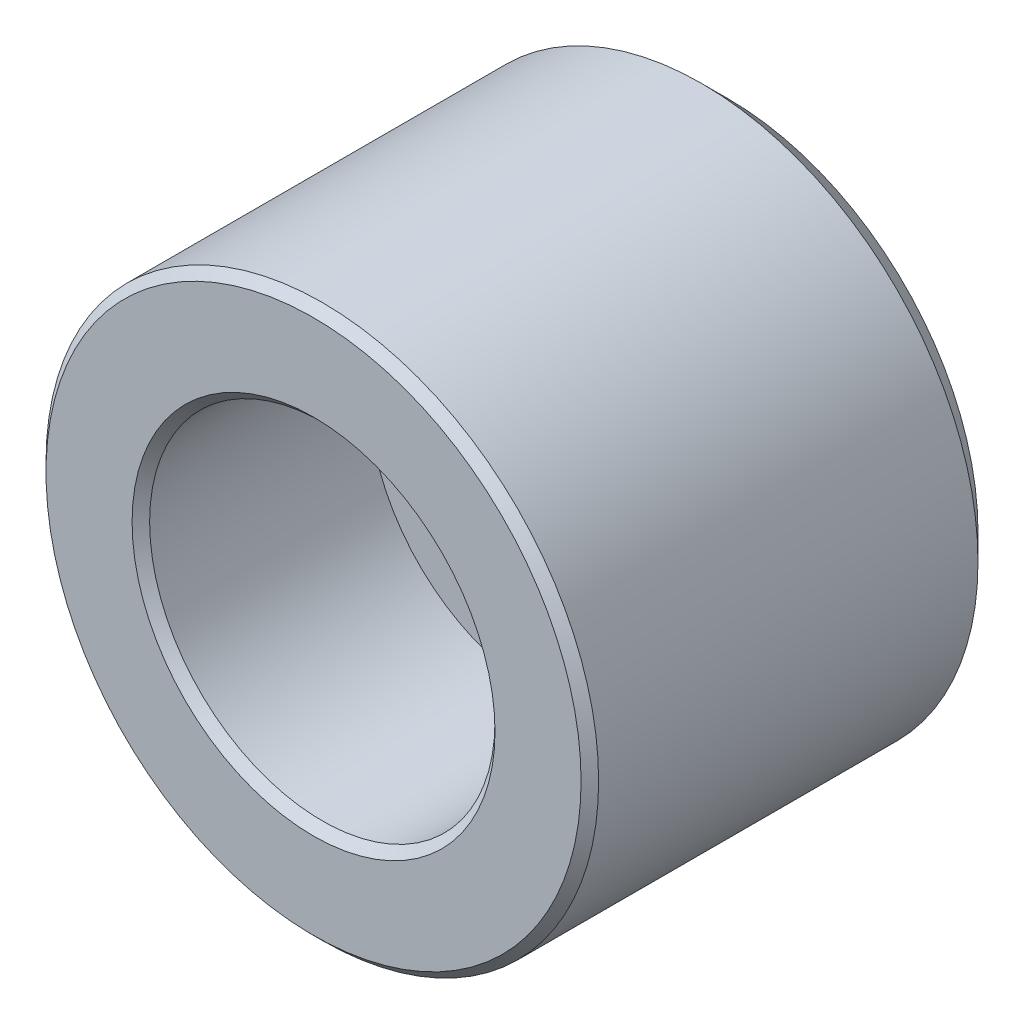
ISO-10303-21;
HEADER;
FILE_DESCRIPTION(('STEP AP214'),'2;1');
FILE_NAME('part.step','',(''),(''),'','','');
FILE_SCHEMA(('AUTOMOTIVE_DESIGN { 1 0 10303 214 1 1 1 1 }'));
ENDSEC;
DATA;
#1=APPLICATION_CONTEXT('core data for automotive mechanical design processes');
#2=APPLICATION_PROTOCOL_DEFINITION('international standard','automotive_design',2000,#1);
#3=PRODUCT_CONTEXT('',#1,'mechanical');
#4=PRODUCT('Part','Part','',(#3));
#5=PRODUCT_RELATED_PRODUCT_CATEGORY('part','',(#4));
#6=PRODUCT_DEFINITION_FORMATION('','',#4);
#7=PRODUCT_DEFINITION_CONTEXT('part definition',#1,'design');
#8=PRODUCT_DEFINITION('design','',#6,#7);
#9=PRODUCT_DEFINITION_SHAPE('','',#8);
#10=(LENGTH_UNIT() NAMED_UNIT(*) SI_UNIT(.MILLI.,.METRE.));
#11=(NAMED_UNIT(*) PLANE_ANGLE_UNIT() SI_UNIT($,.RADIAN.));
#12=(NAMED_UNIT(*) SI_UNIT($,.STERADIAN.) SOLID_ANGLE_UNIT());
#13=UNCERTAINTY_MEASURE_WITH_UNIT(LENGTH_MEASURE(1.E-05),#10,'distance_accuracy_value','');
#14=(GEOMETRIC_REPRESENTATION_CONTEXT(3) GLOBAL_UNCERTAINTY_ASSIGNED_CONTEXT((#13)) GLOBAL_UNIT_ASSIGNED_CONTEXT((#10,
#11,#12)) REPRESENTATION_CONTEXT('',''));
#15=CARTESIAN_POINT('',(0.,0.,0.));
#16=DIRECTION('',(0.,0.,1.));
#17=DIRECTION('',(1.,0.,0.));
#18=AXIS2_PLACEMENT_3D('',#15,#16,#17);
#19=CARTESIAN_POINT('',(0.,0.,12.));
#20=DIRECTION('',(0.,0.,1.));
#21=DIRECTION('',(1.,0.,0.));
#22=AXIS2_PLACEMENT_3D('',#19,#20,#21);
#23=CYLINDRICAL_SURFACE('',#22,2.75);
#24=CARTESIAN_POINT('',(0.,0.,0.2599));
#25=DIRECTION('',(0.,0.,1.));
#26=DIRECTION('',(1.,0.,0.));
#27=AXIS2_PLACEMENT_3D('',#24,#25,#26);
#28=CIRCLE('',#27,2.75);
#29=CARTESIAN_POINT('',(2.75,0.,0.2599));
#30=VERTEX_POINT('',#29);
#31=EDGE_CURVE('E32',#30,#30,#28,.T.);
#32=ORIENTED_EDGE('',*,*,#31,.F.);
#33=EDGE_LOOP('',(#32));
#34=FACE_BOUND('',#33,.T.);
#35=CARTESIAN_POINT('',(0.,0.,5.396));
#36=DIRECTION('',(0.,0.,1.));
#37=DIRECTION('',(1.,0.,0.));
#38=AXIS2_PLACEMENT_3D('',#35,#36,#37);
#39=CIRCLE('',#38,2.75);
#40=CARTESIAN_POINT('',(2.75,0.,5.396));
#41=VERTEX_POINT('',#40);
#42=EDGE_CURVE('E30',#41,#41,#39,.F.);
#43=ORIENTED_EDGE('',*,*,#42,.F.);
#44=EDGE_LOOP('',(#43));
#45=FACE_BOUND('',#44,.T.);
#46=ADVANCED_FACE('F12',(#34,#45),#23,.F.);
#47=CARTESIAN_POINT('',(0.,0.,0.));
#48=DIRECTION('',(0.,0.,1.));
#49=DIRECTION('',(1.,0.,0.));
#50=AXIS2_PLACEMENT_3D('',#47,#48,#49);
#51=CYLINDRICAL_SURFACE('',#50,8.);
#52=CARTESIAN_POINT('',(0.,0.,0.762));
#53=DIRECTION('',(0.,0.,1.));
#54=DIRECTION('',(1.,0.,0.));
#55=AXIS2_PLACEMENT_3D('',#52,#53,#54);
#56=CIRCLE('',#55,8.);
#57=CARTESIAN_POINT('',(8.,0.,0.762));
#58=VERTEX_POINT('',#57);
#59=EDGE_CURVE('E27',#58,#58,#56,.T.);
#60=ORIENTED_EDGE('',*,*,#59,.T.);
#61=EDGE_LOOP('',(#60));
#62=FACE_BOUND('',#61,.T.);
#63=CARTESIAN_POINT('',(0.,0.,11.746));
#64=DIRECTION('',(0.,0.,1.));
#65=DIRECTION('',(1.,0.,0.));
#66=AXIS2_PLACEMENT_3D('',#63,#64,#65);
#67=CIRCLE('',#66,8.);
#68=CARTESIAN_POINT('',(8.,0.,11.746));
#69=VERTEX_POINT('',#68);
#70=EDGE_CURVE('E37',#69,#69,#67,.F.);
#71=ORIENTED_EDGE('',*,*,#70,.T.);
#72=EDGE_LOOP('',(#71));
#73=FACE_BOUND('',#72,.T.);
#74=ADVANCED_FACE('F68',(#62,#73),#51,.T.);
#75=CARTESIAN_POINT('',(0.,0.,0.));
#76=DIRECTION('',(0.,0.,1.));
#77=DIRECTION('',(1.,0.,0.));
#78=AXIS2_PLACEMENT_3D('',#75,#76,#77);
#79=PLANE('',#78);
#80=CARTESIAN_POINT('',(0.,0.,0.));
#81=DIRECTION('',(0.,0.,1.));
#82=DIRECTION('',(1.,0.,0.));
#83=AXIS2_PLACEMENT_3D('',#80,#81,#82);
#84=CIRCLE('',#83,3.0099);
#85=CARTESIAN_POINT('',(3.0099,0.,0.));
#86=VERTEX_POINT('',#85);
#87=EDGE_CURVE('E43',#86,#86,#84,.T.);
#88=ORIENTED_EDGE('',*,*,#87,.T.);
#89=EDGE_LOOP('',(#88));
#90=FACE_BOUND('',#89,.T.);
#91=CARTESIAN_POINT('',(0.,0.,0.));
#92=DIRECTION('',(0.,0.,1.));
#93=DIRECTION('',(1.,0.,0.));
#94=AXIS2_PLACEMENT_3D('',#91,#92,#93);
#95=CIRCLE('',#94,7.238);
#96=CARTESIAN_POINT('',(7.238,0.,0.));
#97=VERTEX_POINT('',#96);
#98=EDGE_CURVE('E23',#97,#97,#95,.F.);
#99=ORIENTED_EDGE('',*,*,#98,.T.);
#100=EDGE_LOOP('',(#99));
#101=FACE_BOUND('',#100,.T.);
#102=ADVANCED_FACE('F74',(#90,#101),#79,.F.);
#103=CARTESIAN_POINT('',(0.,0.,12.));
#104=DIRECTION('',(0.,0.,1.));
#105=DIRECTION('',(1.,0.,0.));
#106=AXIS2_PLACEMENT_3D('',#103,#104,#105);
#107=PLANE('',#106);
#108=CARTESIAN_POINT('',(0.,0.,12.));
#109=DIRECTION('',(0.,0.,1.));
#110=DIRECTION('',(1.,0.,0.));
#111=AXIS2_PLACEMENT_3D('',#108,#109,#110);
#112=CIRCLE('',#111,5.254);
#113=CARTESIAN_POINT('',(5.254,0.,12.));
#114=VERTEX_POINT('',#113);
#115=EDGE_CURVE('E8',#114,#114,#112,.F.);
#116=ORIENTED_EDGE('',*,*,#115,.T.);
#117=EDGE_LOOP('',(#116));
#118=FACE_BOUND('',#117,.T.);
#119=CARTESIAN_POINT('',(0.,0.,12.));
#120=DIRECTION('',(0.,0.,1.));
#121=DIRECTION('',(1.,0.,0.));
#122=AXIS2_PLACEMENT_3D('',#119,#120,#121);
#123=CIRCLE('',#122,7.746);
#124=CARTESIAN_POINT('',(7.746,0.,12.));
#125=VERTEX_POINT('',#124);
#126=EDGE_CURVE('E40',#125,#125,#123,.T.);
#127=ORIENTED_EDGE('',*,*,#126,.T.);
#128=EDGE_LOOP('',(#127));
#129=FACE_BOUND('',#128,.T.);
#130=ADVANCED_FACE('F86',(#118,#129),#107,.T.);
#131=CARTESIAN_POINT('',(0.,0.,12.));
#132=DIRECTION('',(0.,0.,-1.));
#133=DIRECTION('',(-1.,0.,0.));
#134=AXIS2_PLACEMENT_3D('',#131,#132,#133);
#135=CONICAL_SURFACE('',#134,7.746,0.785398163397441);
#136=ORIENTED_EDGE('',*,*,#70,.F.);
#137=EDGE_LOOP('',(#136));
#138=FACE_BOUND('',#137,.T.);
#139=ORIENTED_EDGE('',*,*,#126,.F.);
#140=EDGE_LOOP('',(#139));
#141=FACE_BOUND('',#140,.T.);
#142=ADVANCED_FACE('F89',(#138,#141),#135,.T.);
#143=CARTESIAN_POINT('',(0.,0.,0.762));
#144=DIRECTION('',(0.,0.,1.));
#145=DIRECTION('',(1.,0.,0.));
#146=AXIS2_PLACEMENT_3D('',#143,#144,#145);
#147=CONICAL_SURFACE('',#146,8.,0.785398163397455);
#148=ORIENTED_EDGE('',*,*,#98,.F.);
#149=EDGE_LOOP('',(#148));
#150=FACE_BOUND('',#149,.T.);
#151=ORIENTED_EDGE('',*,*,#59,.F.);
#152=EDGE_LOOP('',(#151));
#153=FACE_BOUND('',#152,.T.);
#154=ADVANCED_FACE('F82',(#150,#153),#147,.T.);
#155=CARTESIAN_POINT('',(0.,0.,0.2599));
#156=DIRECTION('',(0.,0.,-1.));
#157=DIRECTION('',(-1.,0.,0.));
#158=AXIS2_PLACEMENT_3D('',#155,#156,#157);
#159=CONICAL_SURFACE('',#158,2.75,0.785398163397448);
#160=ORIENTED_EDGE('',*,*,#87,.F.);
#161=EDGE_LOOP('',(#160));
#162=FACE_BOUND('',#161,.T.);
#163=ORIENTED_EDGE('',*,*,#31,.T.);
#164=EDGE_LOOP('',(#163));
#165=FACE_BOUND('',#164,.T.);
#166=ADVANCED_FACE('F64',(#162,#165),#159,.F.);
#167=CARTESIAN_POINT('',(0.,0.,5.396));
#168=DIRECTION('',(0.,0.,1.));
#169=DIRECTION('',(1.,0.,0.));
#170=AXIS2_PLACEMENT_3D('',#167,#168,#169);
#171=PLANE('',#170);
#172=CARTESIAN_POINT('',(0.,0.,5.396));
#173=DIRECTION('',(0.,0.,1.));
#174=DIRECTION('',(1.,0.,0.));
#175=AXIS2_PLACEMENT_3D('',#172,#173,#174);
#176=CIRCLE('',#175,5.);
#177=CARTESIAN_POINT('',(5.,0.,5.396));
#178=VERTEX_POINT('',#177);
#179=EDGE_CURVE('E33',#178,#178,#176,.T.);
#180=ORIENTED_EDGE('',*,*,#179,.T.);
#181=EDGE_LOOP('',(#180));
#182=FACE_BOUND('',#181,.T.);
#183=ORIENTED_EDGE('',*,*,#42,.T.);
#184=EDGE_LOOP('',(#183));
#185=FACE_BOUND('',#184,.T.);
#186=ADVANCED_FACE('F51',(#182,#185),#171,.T.);
#187=CARTESIAN_POINT('',(0.,0.,5.396));
#188=DIRECTION('',(0.,0.,1.));
#189=DIRECTION('',(1.,0.,0.));
#190=AXIS2_PLACEMENT_3D('',#187,#188,#189);
#191=CYLINDRICAL_SURFACE('',#190,5.);
#192=CARTESIAN_POINT('',(0.,0.,11.746));
#193=DIRECTION('',(0.,0.,1.));
#194=DIRECTION('',(1.,0.,0.));
#195=AXIS2_PLACEMENT_3D('',#192,#193,#194);
#196=CIRCLE('',#195,5.);
#197=CARTESIAN_POINT('',(5.,0.,11.746));
#198=VERTEX_POINT('',#197);
#199=EDGE_CURVE('E19',#198,#198,#196,.T.);
#200=ORIENTED_EDGE('',*,*,#199,.T.);
#201=EDGE_LOOP('',(#200));
#202=FACE_BOUND('',#201,.T.);
#203=ORIENTED_EDGE('',*,*,#179,.F.);
#204=EDGE_LOOP('',(#203));
#205=FACE_BOUND('',#204,.T.);
#206=ADVANCED_FACE('F54',(#202,#205),#191,.F.);
#207=CARTESIAN_POINT('',(0.,0.,11.746));
#208=DIRECTION('',(0.,0.,1.));
#209=DIRECTION('',(1.,0.,0.));
#210=AXIS2_PLACEMENT_3D('',#207,#208,#209);
#211=CONICAL_SURFACE('',#210,5.,0.78539816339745);
#212=ORIENTED_EDGE('',*,*,#115,.F.);
#213=EDGE_LOOP('',(#212));
#214=FACE_BOUND('',#213,.T.);
#215=ORIENTED_EDGE('',*,*,#199,.F.);
#216=EDGE_LOOP('',(#215));
#217=FACE_BOUND('',#216,.T.);
#218=ADVANCED_FACE('F14',(#214,#217),#211,.F.);
#219=CLOSED_SHELL('',(#46,#74,#102,#130,#142,#154,#166,#186,#206,#218));
#220=MANIFOLD_SOLID_BREP('B1',#219);
#221=ADVANCED_BREP_SHAPE_REPRESENTATION('',(#18,#220),#14);
#222=SHAPE_DEFINITION_REPRESENTATION(#9,#221);
ENDSEC;
END-ISO-10303-21;
